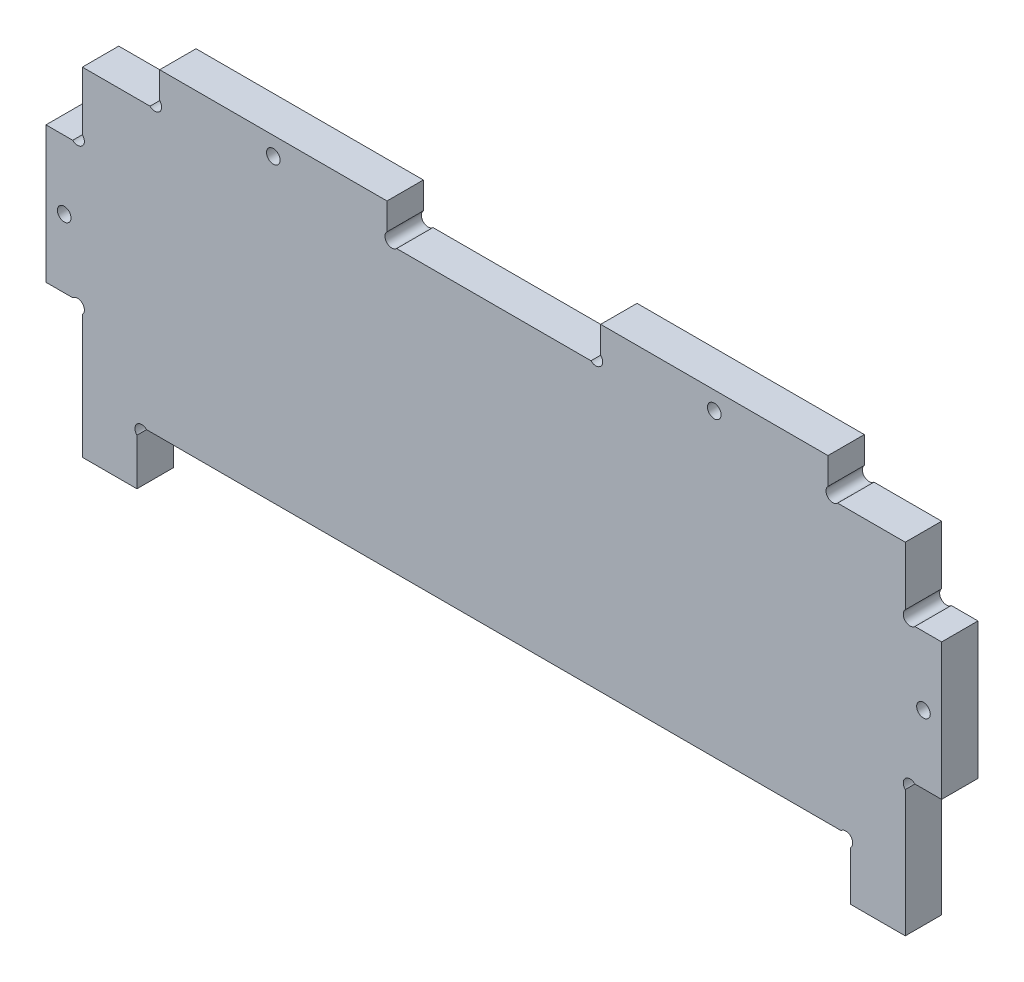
ISO-10303-21;
HEADER;
FILE_DESCRIPTION(('STEP AP214'),'2;1');
FILE_NAME('part.step','',(''),(''),'','','');
FILE_SCHEMA(('AUTOMOTIVE_DESIGN { 1 0 10303 214 1 1 1 1 }'));
ENDSEC;
DATA;
#1=APPLICATION_CONTEXT('core data for automotive mechanical design processes');
#2=APPLICATION_PROTOCOL_DEFINITION('international standard','automotive_design',2000,#1);
#3=PRODUCT_CONTEXT('',#1,'mechanical');
#4=PRODUCT('Part','Part','',(#3));
#5=PRODUCT_RELATED_PRODUCT_CATEGORY('part','',(#4));
#6=PRODUCT_DEFINITION_FORMATION('','',#4);
#7=PRODUCT_DEFINITION_CONTEXT('part definition',#1,'design');
#8=PRODUCT_DEFINITION('design','',#6,#7);
#9=PRODUCT_DEFINITION_SHAPE('','',#8);
#10=(LENGTH_UNIT() NAMED_UNIT(*) SI_UNIT(.MILLI.,.METRE.));
#11=(NAMED_UNIT(*) PLANE_ANGLE_UNIT() SI_UNIT($,.RADIAN.));
#12=(NAMED_UNIT(*) SI_UNIT($,.STERADIAN.) SOLID_ANGLE_UNIT());
#13=UNCERTAINTY_MEASURE_WITH_UNIT(LENGTH_MEASURE(1.E-05),#10,'distance_accuracy_value','');
#14=(GEOMETRIC_REPRESENTATION_CONTEXT(3) GLOBAL_UNCERTAINTY_ASSIGNED_CONTEXT((#13)) GLOBAL_UNIT_ASSIGNED_CONTEXT((#10,
#11,#12)) REPRESENTATION_CONTEXT('',''));
#15=CARTESIAN_POINT('',(0.,0.,0.));
#16=DIRECTION('',(0.,0.,1.));
#17=DIRECTION('',(1.,0.,0.));
#18=AXIS2_PLACEMENT_3D('',#15,#16,#17);
#19=CARTESIAN_POINT('',(74.7749379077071,26.5239492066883,8.));
#20=DIRECTION('',(0.,0.,-1.));
#21=DIRECTION('',(-1.,0.,0.));
#22=AXIS2_PLACEMENT_3D('',#19,#20,#21);
#23=PLANE('',#22);
#24=CARTESIAN_POINT('',(-42.1644019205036,-4.53671096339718,8.));
#25=DIRECTION('',(0.,0.,1.));
#26=DIRECTION('',(1.,0.,0.));
#27=AXIS2_PLACEMENT_3D('',#24,#25,#26);
#28=CIRCLE('',#27,1.5);
#29=CARTESIAN_POINT('',(-40.6644019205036,-4.53671096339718,8.));
#30=VERTEX_POINT('',#29);
#31=EDGE_CURVE('E581',#30,#30,#28,.T.);
#32=ORIENTED_EDGE('',*,*,#31,.F.);
#33=EDGE_LOOP('',(#32));
#34=FACE_BOUND('',#33,.T.);
#35=CARTESIAN_POINT('',(100.835598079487,29.4632890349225,8.));
#36=DIRECTION('',(0.,0.,1.));
#37=DIRECTION('',(-1.,0.,0.));
#38=AXIS2_PLACEMENT_3D('',#35,#36,#37);
#39=CIRCLE('',#38,1.5);
#40=CARTESIAN_POINT('',(99.3355980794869,29.4632890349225,8.));
#41=VERTEX_POINT('',#40);
#42=EDGE_CURVE('E288',#41,#41,#39,.T.);
#43=ORIENTED_EDGE('',*,*,#42,.F.);
#44=EDGE_LOOP('',(#43));
#45=FACE_BOUND('',#44,.T.);
#46=DIRECTION('',(0.,1.,0.));
#47=VECTOR('',#46,1.);
#48=CARTESIAN_POINT('',(125.835598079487,27.5846093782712,8.));
#49=LINE('',#48,#47);
#50=CARTESIAN_POINT('',(125.835598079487,27.5846093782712,8.));
#51=VERTEX_POINT('',#50);
#52=CARTESIAN_POINT('',(125.835598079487,33.4632890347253,8.));
#53=VERTEX_POINT('',#52);
#54=EDGE_CURVE('E355',#51,#53,#49,.T.);
#55=ORIENTED_EDGE('',*,*,#54,.T.);
#56=DIRECTION('',(-1.,0.,0.));
#57=VECTOR('',#56,1.);
#58=CARTESIAN_POINT('',(125.835598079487,33.4632890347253,8.));
#59=LINE('',#58,#57);
#60=CARTESIAN_POINT('',(75.8355980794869,33.4632890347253,8.));
#61=VERTEX_POINT('',#60);
#62=EDGE_CURVE('E170',#53,#61,#59,.T.);
#63=ORIENTED_EDGE('',*,*,#62,.T.);
#64=DIRECTION('',(0.,-1.,0.));
#65=VECTOR('',#64,1.);
#66=CARTESIAN_POINT('',(75.8355980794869,33.4632890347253,8.));
#67=LINE('',#66,#65);
#68=CARTESIAN_POINT('',(75.8355980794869,27.5846093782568,8.));
#69=VERTEX_POINT('',#68);
#70=EDGE_CURVE('E448',#61,#69,#67,.T.);
#71=ORIENTED_EDGE('',*,*,#70,.T.);
#72=CARTESIAN_POINT('',(74.7749379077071,26.5239492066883,8.));
#73=DIRECTION('',(0.,0.,-1.));
#74=DIRECTION('',(-1.,0.,0.));
#75=AXIS2_PLACEMENT_3D('',#72,#73,#74);
#76=CIRCLE('',#75,1.49999999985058);
#77=CARTESIAN_POINT('',(73.7142777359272,25.4632890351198,8.));
#78=VERTEX_POINT('',#77);
#79=EDGE_CURVE('E467',#69,#78,#76,.T.);
#80=ORIENTED_EDGE('',*,*,#79,.T.);
#81=DIRECTION('',(-1.,0.,0.));
#82=VECTOR('',#81,1.);
#83=CARTESIAN_POINT('',(30.9569184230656,25.4632890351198,8.));
#84=LINE('',#83,#82);
#85=CARTESIAN_POINT('',(30.9569184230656,25.4632890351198,8.));
#86=VERTEX_POINT('',#85);
#87=EDGE_CURVE('E464',#78,#86,#84,.T.);
#88=ORIENTED_EDGE('',*,*,#87,.T.);
#89=CARTESIAN_POINT('',(29.8962582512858,26.5239492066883,8.));
#90=DIRECTION('',(0.,0.,-1.));
#91=DIRECTION('',(1.,0.,0.));
#92=AXIS2_PLACEMENT_3D('',#89,#90,#91);
#93=CIRCLE('',#92,1.49999999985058);
#94=CARTESIAN_POINT('',(28.835598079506,27.5846093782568,8.));
#95=VERTEX_POINT('',#94);
#96=EDGE_CURVE('E466',#86,#95,#93,.T.);
#97=ORIENTED_EDGE('',*,*,#96,.T.);
#98=DIRECTION('',(0.,1.,0.));
#99=VECTOR('',#98,1.);
#100=CARTESIAN_POINT('',(28.835598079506,33.4632890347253,8.));
#101=LINE('',#100,#99);
#102=CARTESIAN_POINT('',(28.835598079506,33.4632890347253,8.));
#103=VERTEX_POINT('',#102);
#104=EDGE_CURVE('E469',#95,#103,#101,.T.);
#105=ORIENTED_EDGE('',*,*,#104,.T.);
#106=DIRECTION('',(-1.,0.,0.));
#107=VECTOR('',#106,1.);
#108=CARTESIAN_POINT('',(-21.164401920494,33.4632890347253,8.));
#109=LINE('',#108,#107);
#110=CARTESIAN_POINT('',(-21.164401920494,33.4632890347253,8.));
#111=VERTEX_POINT('',#110);
#112=EDGE_CURVE('E475',#103,#111,#109,.T.);
#113=ORIENTED_EDGE('',*,*,#112,.T.);
#114=DIRECTION('',(0.,-1.,0.));
#115=VECTOR('',#114,1.);
#116=CARTESIAN_POINT('',(-21.164401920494,27.5846093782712,8.));
#117=LINE('',#116,#115);
#118=CARTESIAN_POINT('',(-21.164401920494,27.5846093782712,8.));
#119=VERTEX_POINT('',#118);
#120=EDGE_CURVE('E477',#111,#119,#117,.T.);
#121=ORIENTED_EDGE('',*,*,#120,.T.);
#122=CARTESIAN_POINT('',(-22.2250620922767,26.5239492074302,8.));
#123=DIRECTION('',(0.,0.,-1.));
#124=DIRECTION('',(1.,0.,0.));
#125=AXIS2_PLACEMENT_3D('',#122,#123,#124);
#126=CIRCLE('',#125,1.49999999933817);
#127=CARTESIAN_POINT('',(-23.2857222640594,25.4632890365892,8.));
#128=VERTEX_POINT('',#127);
#129=EDGE_CURVE('E479',#119,#128,#126,.T.);
#130=ORIENTED_EDGE('',*,*,#129,.T.);
#131=DIRECTION('',(-1.,0.,0.));
#132=VECTOR('',#131,1.);
#133=CARTESIAN_POINT('',(-38.1644019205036,25.4632890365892,8.));
#134=LINE('',#133,#132);
#135=CARTESIAN_POINT('',(-38.1644019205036,25.4632890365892,8.));
#136=VERTEX_POINT('',#135);
#137=EDGE_CURVE('E481',#128,#136,#134,.T.);
#138=ORIENTED_EDGE('',*,*,#137,.T.);
#139=DIRECTION('',(0.,-1.,0.));
#140=VECTOR('',#139,1.);
#141=CARTESIAN_POINT('',(-38.1644019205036,13.0239492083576,8.));
#142=LINE('',#141,#140);
#143=CARTESIAN_POINT('',(-38.1644019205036,12.5846093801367,8.));
#144=VERTEX_POINT('',#143);
#145=EDGE_CURVE('E483',#136,#144,#142,.T.);
#146=ORIENTED_EDGE('',*,*,#145,.T.);
#147=CARTESIAN_POINT('',(-39.2250620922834,11.5239492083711,8.));
#148=DIRECTION('',(0.,0.,-1.));
#149=DIRECTION('',(1.,0.,0.));
#150=AXIS2_PLACEMENT_3D('',#147,#148,#149);
#151=CIRCLE('',#150,1.49999999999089);
#152=CARTESIAN_POINT('',(-40.2857222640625,10.4632890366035,8.));
#153=VERTEX_POINT('',#152);
#154=EDGE_CURVE('E485',#144,#153,#151,.T.);
#155=ORIENTED_EDGE('',*,*,#154,.T.);
#156=DIRECTION('',(-1.,0.,0.));
#157=VECTOR('',#156,1.);
#158=CARTESIAN_POINT('',(-46.1644019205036,10.4632890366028,8.));
#159=LINE('',#158,#157);
#160=CARTESIAN_POINT('',(-46.1644019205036,10.4632890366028,8.));
#161=VERTEX_POINT('',#160);
#162=EDGE_CURVE('E487',#153,#161,#159,.T.);
#163=ORIENTED_EDGE('',*,*,#162,.T.);
#164=DIRECTION('',(0.,-1.,0.));
#165=VECTOR('',#164,1.);
#166=CARTESIAN_POINT('',(-46.1644019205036,-19.5367109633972,8.));
#167=LINE('',#166,#165);
#168=CARTESIAN_POINT('',(-46.1644019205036,-19.5367109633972,8.));
#169=VERTEX_POINT('',#168);
#170=EDGE_CURVE('E489',#161,#169,#167,.T.);
#171=ORIENTED_EDGE('',*,*,#170,.T.);
#172=DIRECTION('',(1.,0.,0.));
#173=VECTOR('',#172,1.);
#174=CARTESIAN_POINT('',(-40.2857222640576,-19.5367109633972,8.));
#175=LINE('',#174,#173);
#176=CARTESIAN_POINT('',(-40.2857222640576,-19.5367109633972,8.));
#177=VERTEX_POINT('',#176);
#178=EDGE_CURVE('E491',#169,#177,#175,.T.);
#179=ORIENTED_EDGE('',*,*,#178,.T.);
#180=CARTESIAN_POINT('',(-39.2250620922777,-20.597371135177,8.));
#181=DIRECTION('',(0.,0.,-1.));
#182=DIRECTION('',(1.,0.,0.));
#183=AXIS2_PLACEMENT_3D('',#180,#181,#182);
#184=CIRCLE('',#183,1.5);
#185=CARTESIAN_POINT('',(-38.1644019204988,-21.6580313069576,8.));
#186=VERTEX_POINT('',#185);
#187=EDGE_CURVE('E493',#177,#186,#184,.T.);
#188=ORIENTED_EDGE('',*,*,#187,.T.);
#189=DIRECTION('',(0.,-1.,0.));
#190=VECTOR('',#189,1.);
#191=CARTESIAN_POINT('',(-38.1644019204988,-22.0973711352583,8.));
#192=LINE('',#191,#190);
#193=CARTESIAN_POINT('',(-38.1644019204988,-48.8692711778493,8.));
#194=VERTEX_POINT('',#193);
#195=EDGE_CURVE('E495',#186,#194,#192,.T.);
#196=ORIENTED_EDGE('',*,*,#195,.T.);
#197=DIRECTION('',(1.,0.,0.));
#198=VECTOR('',#197,1.);
#199=CARTESIAN_POINT('',(-38.1644019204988,-48.8692711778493,8.));
#200=LINE('',#199,#198);
#201=CARTESIAN_POINT('',(-26.1644019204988,-48.8692711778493,8.));
#202=VERTEX_POINT('',#201);
#203=EDGE_CURVE('E497',#194,#202,#200,.T.);
#204=ORIENTED_EDGE('',*,*,#203,.T.);
#205=DIRECTION('',(0.,1.,0.));
#206=VECTOR('',#205,1.);
#207=CARTESIAN_POINT('',(-26.1644019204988,-48.8692711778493,8.));
#208=LINE('',#207,#206);
#209=CARTESIAN_POINT('',(-26.1644019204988,-38.6580313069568,8.));
#210=VERTEX_POINT('',#209);
#211=EDGE_CURVE('E499',#202,#210,#208,.T.);
#212=ORIENTED_EDGE('',*,*,#211,.T.);
#213=CARTESIAN_POINT('',(-25.1037417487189,-37.597371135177,8.));
#214=DIRECTION('',(0.,0.,-1.));
#215=DIRECTION('',(1.,0.,0.));
#216=AXIS2_PLACEMENT_3D('',#213,#214,#215);
#217=CIRCLE('',#216,1.50000000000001);
#218=CARTESIAN_POINT('',(-24.0430815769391,-36.5367109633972,8.));
#219=VERTEX_POINT('',#218);
#220=EDGE_CURVE('E501',#210,#219,#217,.T.);
#221=ORIENTED_EDGE('',*,*,#220,.T.);
#222=DIRECTION('',(1.,0.,0.));
#223=VECTOR('',#222,1.);
#224=CARTESIAN_POINT('',(-24.0430815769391,-36.5367109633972,8.));
#225=LINE('',#224,#223);
#226=CARTESIAN_POINT('',(128.714277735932,-36.5367109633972,8.));
#227=VERTEX_POINT('',#226);
#228=EDGE_CURVE('E503',#219,#227,#225,.T.);
#229=ORIENTED_EDGE('',*,*,#228,.T.);
#230=CARTESIAN_POINT('',(129.774937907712,-37.597371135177,8.));
#231=DIRECTION('',(0.,0.,-1.));
#232=DIRECTION('',(1.,0.,0.));
#233=AXIS2_PLACEMENT_3D('',#230,#231,#232);
#234=CIRCLE('',#233,1.5);
#235=CARTESIAN_POINT('',(130.835598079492,-38.6580313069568,8.));
#236=VERTEX_POINT('',#235);
#237=EDGE_CURVE('E505',#227,#236,#234,.T.);
#238=ORIENTED_EDGE('',*,*,#237,.T.);
#239=DIRECTION('',(0.,-1.,0.));
#240=VECTOR('',#239,1.);
#241=CARTESIAN_POINT('',(130.835598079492,-49.5367109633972,8.));
#242=LINE('',#241,#240);
#243=CARTESIAN_POINT('',(130.835598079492,-49.5367109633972,8.));
#244=VERTEX_POINT('',#243);
#245=EDGE_CURVE('E507',#236,#244,#242,.T.);
#246=ORIENTED_EDGE('',*,*,#245,.T.);
#247=DIRECTION('',(1.,0.,0.));
#248=VECTOR('',#247,1.);
#249=CARTESIAN_POINT('',(142.835598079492,-49.5367109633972,8.));
#250=LINE('',#249,#248);
#251=CARTESIAN_POINT('',(142.835598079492,-49.5367109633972,8.));
#252=VERTEX_POINT('',#251);
#253=EDGE_CURVE('E509',#244,#252,#250,.T.);
#254=ORIENTED_EDGE('',*,*,#253,.T.);
#255=DIRECTION('',(0.,1.,0.));
#256=VECTOR('',#255,1.);
#257=CARTESIAN_POINT('',(142.835598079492,-36.5367109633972,8.));
#258=LINE('',#257,#256);
#259=CARTESIAN_POINT('',(142.835598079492,-21.6580313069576,8.));
#260=VERTEX_POINT('',#259);
#261=EDGE_CURVE('E511',#252,#260,#258,.T.);
#262=ORIENTED_EDGE('',*,*,#261,.T.);
#263=CARTESIAN_POINT('',(143.896258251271,-20.597371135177,8.));
#264=DIRECTION('',(0.,0.,-1.));
#265=DIRECTION('',(-1.,0.,0.));
#266=AXIS2_PLACEMENT_3D('',#263,#264,#265);
#267=CIRCLE('',#266,1.50000000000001);
#268=CARTESIAN_POINT('',(144.95691842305,-19.5367109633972,8.));
#269=VERTEX_POINT('',#268);
#270=EDGE_CURVE('E513',#260,#269,#267,.T.);
#271=ORIENTED_EDGE('',*,*,#270,.T.);
#272=DIRECTION('',(1.,0.,0.));
#273=VECTOR('',#272,1.);
#274=CARTESIAN_POINT('',(144.95691842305,-19.5367109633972,8.));
#275=LINE('',#274,#273);
#276=CARTESIAN_POINT('',(150.835598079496,-19.5367109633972,8.));
#277=VERTEX_POINT('',#276);
#278=EDGE_CURVE('E515',#269,#277,#275,.T.);
#279=ORIENTED_EDGE('',*,*,#278,.T.);
#280=DIRECTION('',(0.,1.,0.));
#281=VECTOR('',#280,1.);
#282=CARTESIAN_POINT('',(150.835598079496,-19.5367109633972,8.));
#283=LINE('',#282,#281);
#284=CARTESIAN_POINT('',(150.835598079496,10.4632890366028,8.));
#285=VERTEX_POINT('',#284);
#286=EDGE_CURVE('E517',#277,#285,#283,.T.);
#287=ORIENTED_EDGE('',*,*,#286,.T.);
#288=DIRECTION('',(-1.,0.,0.));
#289=VECTOR('',#288,1.);
#290=CARTESIAN_POINT('',(150.835598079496,10.4632890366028,8.));
#291=LINE('',#290,#289);
#292=CARTESIAN_POINT('',(144.956918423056,10.4632890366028,8.));
#293=VERTEX_POINT('',#292);
#294=EDGE_CURVE('E519',#285,#293,#291,.T.);
#295=ORIENTED_EDGE('',*,*,#294,.T.);
#296=CARTESIAN_POINT('',(143.896258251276,11.5239492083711,8.));
#297=DIRECTION('',(0.,0.,-1.));
#298=DIRECTION('',(-1.,0.,0.));
#299=AXIS2_PLACEMENT_3D('',#296,#297,#298);
#300=CIRCLE('',#299,1.4999999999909);
#301=CARTESIAN_POINT('',(142.835598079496,12.5846093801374,8.));
#302=VERTEX_POINT('',#301);
#303=EDGE_CURVE('E267',#293,#302,#300,.T.);
#304=ORIENTED_EDGE('',*,*,#303,.T.);
#305=DIRECTION('',(0.,1.,0.));
#306=VECTOR('',#305,1.);
#307=CARTESIAN_POINT('',(142.835598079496,12.5846093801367,8.));
#308=LINE('',#307,#306);
#309=CARTESIAN_POINT('',(142.835598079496,25.4632890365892,8.));
#310=VERTEX_POINT('',#309);
#311=EDGE_CURVE('E261',#302,#310,#308,.T.);
#312=ORIENTED_EDGE('',*,*,#311,.T.);
#313=DIRECTION('',(-1.,0.,0.));
#314=VECTOR('',#313,1.);
#315=CARTESIAN_POINT('',(142.835598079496,25.4632890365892,8.));
#316=LINE('',#315,#314);
#317=CARTESIAN_POINT('',(127.956918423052,25.4632890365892,8.));
#318=VERTEX_POINT('',#317);
#319=EDGE_CURVE('E265',#310,#318,#316,.T.);
#320=ORIENTED_EDGE('',*,*,#319,.T.);
#321=CARTESIAN_POINT('',(126.89625825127,26.5239492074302,8.));
#322=DIRECTION('',(0.,0.,-1.));
#323=DIRECTION('',(-1.,0.,0.));
#324=AXIS2_PLACEMENT_3D('',#321,#322,#323);
#325=CIRCLE('',#324,1.49999999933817);
#326=EDGE_CURVE('E49',#318,#51,#325,.T.);
#327=ORIENTED_EDGE('',*,*,#326,.T.);
#328=EDGE_LOOP('',(#55,#63,#71,#80,#88,#97,#105,#113,#121,#130,#138,#146,#155,#163,#171,#179,
#188,#196,#204,#212,#221,#229,#238,#246,#254,#262,#271,#279,#287,#295,#304,#312,#320,#327));
#329=FACE_BOUND('',#328,.T.);
#330=CARTESIAN_POINT('',(146.835598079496,-4.53671096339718,8.));
#331=DIRECTION('',(0.,0.,1.));
#332=DIRECTION('',(-1.,0.,0.));
#333=AXIS2_PLACEMENT_3D('',#330,#331,#332);
#334=CIRCLE('',#333,1.5);
#335=CARTESIAN_POINT('',(145.335598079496,-4.53671096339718,8.));
#336=VERTEX_POINT('',#335);
#337=EDGE_CURVE('E587',#336,#336,#334,.T.);
#338=ORIENTED_EDGE('',*,*,#337,.F.);
#339=EDGE_LOOP('',(#338));
#340=FACE_BOUND('',#339,.T.);
#341=CARTESIAN_POINT('',(3.83559807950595,29.4632890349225,8.));
#342=DIRECTION('',(0.,0.,1.));
#343=DIRECTION('',(1.,0.,0.));
#344=AXIS2_PLACEMENT_3D('',#341,#342,#343);
#345=CIRCLE('',#344,1.5);
#346=CARTESIAN_POINT('',(5.33559807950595,29.4632890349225,8.));
#347=VERTEX_POINT('',#346);
#348=EDGE_CURVE('E572',#347,#347,#345,.T.);
#349=ORIENTED_EDGE('',*,*,#348,.F.);
#350=EDGE_LOOP('',(#349));
#351=FACE_BOUND('',#350,.T.);
#352=ADVANCED_FACE('F32',(#34,#45,#329,#340,#351),#23,.F.);
#353=CARTESIAN_POINT('',(74.7749379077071,26.5239492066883,0.));
#354=DIRECTION('',(0.,0.,-1.));
#355=DIRECTION('',(-1.,0.,0.));
#356=AXIS2_PLACEMENT_3D('',#353,#354,#355);
#357=PLANE('',#356);
#358=CARTESIAN_POINT('',(-42.1644019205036,-4.53671096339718,0.));
#359=DIRECTION('',(0.,0.,1.));
#360=DIRECTION('',(1.,0.,0.));
#361=AXIS2_PLACEMENT_3D('',#358,#359,#360);
#362=CIRCLE('',#361,1.5);
#363=CARTESIAN_POINT('',(-40.6644019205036,-4.53671096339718,0.));
#364=VERTEX_POINT('',#363);
#365=EDGE_CURVE('E578',#364,#364,#362,.T.);
#366=ORIENTED_EDGE('',*,*,#365,.T.);
#367=EDGE_LOOP('',(#366));
#368=FACE_BOUND('',#367,.T.);
#369=CARTESIAN_POINT('',(100.835598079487,29.4632890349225,0.));
#370=DIRECTION('',(0.,0.,1.));
#371=DIRECTION('',(-1.,0.,0.));
#372=AXIS2_PLACEMENT_3D('',#369,#370,#371);
#373=CIRCLE('',#372,1.5);
#374=CARTESIAN_POINT('',(99.3355980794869,29.4632890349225,0.));
#375=VERTEX_POINT('',#374);
#376=EDGE_CURVE('E590',#375,#375,#373,.T.);
#377=ORIENTED_EDGE('',*,*,#376,.T.);
#378=EDGE_LOOP('',(#377));
#379=FACE_BOUND('',#378,.T.);
#380=DIRECTION('',(0.,1.,0.));
#381=VECTOR('',#380,1.);
#382=CARTESIAN_POINT('',(125.835598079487,27.5846093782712,0.));
#383=LINE('',#382,#381);
#384=CARTESIAN_POINT('',(125.835598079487,27.5846093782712,0.));
#385=VERTEX_POINT('',#384);
#386=CARTESIAN_POINT('',(125.835598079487,33.4632890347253,0.));
#387=VERTEX_POINT('',#386);
#388=EDGE_CURVE('E284',#385,#387,#383,.T.);
#389=ORIENTED_EDGE('',*,*,#388,.F.);
#390=CARTESIAN_POINT('',(126.89625825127,26.5239492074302,0.));
#391=DIRECTION('',(0.,0.,-1.));
#392=DIRECTION('',(-1.,0.,0.));
#393=AXIS2_PLACEMENT_3D('',#390,#391,#392);
#394=CIRCLE('',#393,1.49999999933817);
#395=CARTESIAN_POINT('',(127.956918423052,25.4632890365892,0.));
#396=VERTEX_POINT('',#395);
#397=EDGE_CURVE('E162',#396,#385,#394,.T.);
#398=ORIENTED_EDGE('',*,*,#397,.F.);
#399=DIRECTION('',(-1.,0.,0.));
#400=VECTOR('',#399,1.);
#401=CARTESIAN_POINT('',(142.835598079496,25.4632890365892,0.));
#402=LINE('',#401,#400);
#403=CARTESIAN_POINT('',(142.835598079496,25.4632890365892,0.));
#404=VERTEX_POINT('',#403);
#405=EDGE_CURVE('E156',#404,#396,#402,.T.);
#406=ORIENTED_EDGE('',*,*,#405,.F.);
#407=DIRECTION('',(0.,1.,0.));
#408=VECTOR('',#407,1.);
#409=CARTESIAN_POINT('',(142.835598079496,13.0239492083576,0.));
#410=LINE('',#409,#408);
#411=CARTESIAN_POINT('',(142.835598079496,12.5846093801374,0.));
#412=VERTEX_POINT('',#411);
#413=EDGE_CURVE('E274',#412,#404,#410,.T.);
#414=ORIENTED_EDGE('',*,*,#413,.F.);
#415=CARTESIAN_POINT('',(143.896258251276,11.5239492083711,0.));
#416=DIRECTION('',(0.,0.,-1.));
#417=DIRECTION('',(-1.,0.,0.));
#418=AXIS2_PLACEMENT_3D('',#415,#416,#417);
#419=CIRCLE('',#418,1.4999999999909);
#420=CARTESIAN_POINT('',(144.956918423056,10.4632890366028,0.));
#421=VERTEX_POINT('',#420);
#422=EDGE_CURVE('E349',#421,#412,#419,.T.);
#423=ORIENTED_EDGE('',*,*,#422,.F.);
#424=DIRECTION('',(-1.,0.,0.));
#425=VECTOR('',#424,1.);
#426=CARTESIAN_POINT('',(150.835598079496,10.4632890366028,0.));
#427=LINE('',#426,#425);
#428=CARTESIAN_POINT('',(150.835598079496,10.4632890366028,0.));
#429=VERTEX_POINT('',#428);
#430=EDGE_CURVE('E347',#429,#421,#427,.T.);
#431=ORIENTED_EDGE('',*,*,#430,.F.);
#432=DIRECTION('',(0.,1.,0.));
#433=VECTOR('',#432,1.);
#434=CARTESIAN_POINT('',(150.835598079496,-19.5367109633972,0.));
#435=LINE('',#434,#433);
#436=CARTESIAN_POINT('',(150.835598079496,-19.5367109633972,0.));
#437=VERTEX_POINT('',#436);
#438=EDGE_CURVE('E345',#437,#429,#435,.T.);
#439=ORIENTED_EDGE('',*,*,#438,.F.);
#440=DIRECTION('',(1.,0.,0.));
#441=VECTOR('',#440,1.);
#442=CARTESIAN_POINT('',(144.95691842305,-19.5367109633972,0.));
#443=LINE('',#442,#441);
#444=CARTESIAN_POINT('',(144.95691842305,-19.5367109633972,0.));
#445=VERTEX_POINT('',#444);
#446=EDGE_CURVE('E343',#445,#437,#443,.T.);
#447=ORIENTED_EDGE('',*,*,#446,.F.);
#448=CARTESIAN_POINT('',(143.896258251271,-20.597371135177,0.));
#449=DIRECTION('',(0.,0.,-1.));
#450=DIRECTION('',(-1.,0.,0.));
#451=AXIS2_PLACEMENT_3D('',#448,#449,#450);
#452=CIRCLE('',#451,1.50000000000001);
#453=CARTESIAN_POINT('',(142.835598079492,-21.6580313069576,0.));
#454=VERTEX_POINT('',#453);
#455=EDGE_CURVE('E341',#454,#445,#452,.T.);
#456=ORIENTED_EDGE('',*,*,#455,.F.);
#457=DIRECTION('',(0.,1.,0.));
#458=VECTOR('',#457,1.);
#459=CARTESIAN_POINT('',(142.835598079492,-22.0973711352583,0.));
#460=LINE('',#459,#458);
#461=CARTESIAN_POINT('',(142.835598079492,-49.5367109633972,0.));
#462=VERTEX_POINT('',#461);
#463=EDGE_CURVE('E339',#462,#454,#460,.T.);
#464=ORIENTED_EDGE('',*,*,#463,.F.);
#465=DIRECTION('',(1.,0.,0.));
#466=VECTOR('',#465,1.);
#467=CARTESIAN_POINT('',(142.835598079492,-49.5367109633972,0.));
#468=LINE('',#467,#466);
#469=CARTESIAN_POINT('',(130.835598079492,-49.5367109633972,0.));
#470=VERTEX_POINT('',#469);
#471=EDGE_CURVE('E336',#470,#462,#468,.T.);
#472=ORIENTED_EDGE('',*,*,#471,.F.);
#473=DIRECTION('',(0.,-1.,0.));
#474=VECTOR('',#473,1.);
#475=CARTESIAN_POINT('',(130.835598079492,-49.5367109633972,0.));
#476=LINE('',#475,#474);
#477=CARTESIAN_POINT('',(130.835598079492,-38.6580313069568,0.));
#478=VERTEX_POINT('',#477);
#479=EDGE_CURVE('E334',#478,#470,#476,.T.);
#480=ORIENTED_EDGE('',*,*,#479,.F.);
#481=CARTESIAN_POINT('',(129.774937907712,-37.597371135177,0.));
#482=DIRECTION('',(0.,0.,-1.));
#483=DIRECTION('',(1.,0.,0.));
#484=AXIS2_PLACEMENT_3D('',#481,#482,#483);
#485=CIRCLE('',#484,1.5);
#486=CARTESIAN_POINT('',(128.714277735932,-36.5367109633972,0.));
#487=VERTEX_POINT('',#486);
#488=EDGE_CURVE('E332',#487,#478,#485,.T.);
#489=ORIENTED_EDGE('',*,*,#488,.F.);
#490=DIRECTION('',(1.,0.,0.));
#491=VECTOR('',#490,1.);
#492=CARTESIAN_POINT('',(-24.0430815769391,-36.5367109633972,0.));
#493=LINE('',#492,#491);
#494=CARTESIAN_POINT('',(-24.0430815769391,-36.5367109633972,0.));
#495=VERTEX_POINT('',#494);
#496=EDGE_CURVE('E330',#495,#487,#493,.T.);
#497=ORIENTED_EDGE('',*,*,#496,.F.);
#498=CARTESIAN_POINT('',(-25.1037417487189,-37.597371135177,0.));
#499=DIRECTION('',(0.,0.,-1.));
#500=DIRECTION('',(1.,0.,0.));
#501=AXIS2_PLACEMENT_3D('',#498,#499,#500);
#502=CIRCLE('',#501,1.50000000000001);
#503=CARTESIAN_POINT('',(-26.1644019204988,-38.6580313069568,0.));
#504=VERTEX_POINT('',#503);
#505=EDGE_CURVE('E328',#504,#495,#502,.T.);
#506=ORIENTED_EDGE('',*,*,#505,.F.);
#507=DIRECTION('',(0.,1.,0.));
#508=VECTOR('',#507,1.);
#509=CARTESIAN_POINT('',(-26.1644019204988,-48.8692711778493,0.));
#510=LINE('',#509,#508);
#511=CARTESIAN_POINT('',(-26.1644019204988,-48.8692711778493,0.));
#512=VERTEX_POINT('',#511);
#513=EDGE_CURVE('E326',#512,#504,#510,.T.);
#514=ORIENTED_EDGE('',*,*,#513,.F.);
#515=DIRECTION('',(1.,0.,0.));
#516=VECTOR('',#515,1.);
#517=CARTESIAN_POINT('',(-38.1644019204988,-48.8692711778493,0.));
#518=LINE('',#517,#516);
#519=CARTESIAN_POINT('',(-38.1644019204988,-48.8692711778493,0.));
#520=VERTEX_POINT('',#519);
#521=EDGE_CURVE('E324',#520,#512,#518,.T.);
#522=ORIENTED_EDGE('',*,*,#521,.F.);
#523=DIRECTION('',(0.,-1.,0.));
#524=VECTOR('',#523,1.);
#525=CARTESIAN_POINT('',(-38.1644019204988,-36.5367109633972,0.));
#526=LINE('',#525,#524);
#527=CARTESIAN_POINT('',(-38.1644019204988,-21.6580313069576,0.));
#528=VERTEX_POINT('',#527);
#529=EDGE_CURVE('E322',#528,#520,#526,.T.);
#530=ORIENTED_EDGE('',*,*,#529,.F.);
#531=CARTESIAN_POINT('',(-39.2250620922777,-20.597371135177,0.));
#532=DIRECTION('',(0.,0.,-1.));
#533=DIRECTION('',(1.,0.,0.));
#534=AXIS2_PLACEMENT_3D('',#531,#532,#533);
#535=CIRCLE('',#534,1.5);
#536=CARTESIAN_POINT('',(-40.2857222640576,-19.5367109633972,0.));
#537=VERTEX_POINT('',#536);
#538=EDGE_CURVE('E319',#537,#528,#535,.T.);
#539=ORIENTED_EDGE('',*,*,#538,.F.);
#540=DIRECTION('',(1.,0.,0.));
#541=VECTOR('',#540,1.);
#542=CARTESIAN_POINT('',(-40.2857222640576,-19.5367109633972,0.));
#543=LINE('',#542,#541);
#544=CARTESIAN_POINT('',(-46.1644019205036,-19.5367109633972,0.));
#545=VERTEX_POINT('',#544);
#546=EDGE_CURVE('E317',#545,#537,#543,.T.);
#547=ORIENTED_EDGE('',*,*,#546,.F.);
#548=DIRECTION('',(0.,-1.,0.));
#549=VECTOR('',#548,1.);
#550=CARTESIAN_POINT('',(-46.1644019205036,-19.5367109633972,0.));
#551=LINE('',#550,#549);
#552=CARTESIAN_POINT('',(-46.1644019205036,10.4632890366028,0.));
#553=VERTEX_POINT('',#552);
#554=EDGE_CURVE('E315',#553,#545,#551,.T.);
#555=ORIENTED_EDGE('',*,*,#554,.F.);
#556=DIRECTION('',(-1.,0.,0.));
#557=VECTOR('',#556,1.);
#558=CARTESIAN_POINT('',(-46.1644019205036,10.4632890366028,0.));
#559=LINE('',#558,#557);
#560=CARTESIAN_POINT('',(-40.2857222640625,10.4632890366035,0.));
#561=VERTEX_POINT('',#560);
#562=EDGE_CURVE('E313',#561,#553,#559,.T.);
#563=ORIENTED_EDGE('',*,*,#562,.F.);
#564=CARTESIAN_POINT('',(-39.2250620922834,11.5239492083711,0.));
#565=DIRECTION('',(0.,0.,-1.));
#566=DIRECTION('',(1.,0.,0.));
#567=AXIS2_PLACEMENT_3D('',#564,#565,#566);
#568=CIRCLE('',#567,1.49999999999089);
#569=CARTESIAN_POINT('',(-38.1644019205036,12.5846093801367,0.));
#570=VERTEX_POINT('',#569);
#571=EDGE_CURVE('E311',#570,#561,#568,.T.);
#572=ORIENTED_EDGE('',*,*,#571,.F.);
#573=DIRECTION('',(0.,-1.,0.));
#574=VECTOR('',#573,1.);
#575=CARTESIAN_POINT('',(-38.1644019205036,12.5846093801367,0.));
#576=LINE('',#575,#574);
#577=CARTESIAN_POINT('',(-38.1644019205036,25.4632890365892,0.));
#578=VERTEX_POINT('',#577);
#579=EDGE_CURVE('E309',#578,#570,#576,.T.);
#580=ORIENTED_EDGE('',*,*,#579,.F.);
#581=DIRECTION('',(-1.,0.,0.));
#582=VECTOR('',#581,1.);
#583=CARTESIAN_POINT('',(-38.1644019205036,25.4632890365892,0.));
#584=LINE('',#583,#582);
#585=CARTESIAN_POINT('',(-23.2857222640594,25.4632890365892,0.));
#586=VERTEX_POINT('',#585);
#587=EDGE_CURVE('E306',#586,#578,#584,.T.);
#588=ORIENTED_EDGE('',*,*,#587,.F.);
#589=CARTESIAN_POINT('',(-22.2250620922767,26.5239492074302,0.));
#590=DIRECTION('',(0.,0.,-1.));
#591=DIRECTION('',(1.,0.,0.));
#592=AXIS2_PLACEMENT_3D('',#589,#590,#591);
#593=CIRCLE('',#592,1.49999999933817);
#594=CARTESIAN_POINT('',(-21.164401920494,27.5846093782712,0.));
#595=VERTEX_POINT('',#594);
#596=EDGE_CURVE('E304',#595,#586,#593,.T.);
#597=ORIENTED_EDGE('',*,*,#596,.F.);
#598=DIRECTION('',(0.,-1.,0.));
#599=VECTOR('',#598,1.);
#600=CARTESIAN_POINT('',(-21.164401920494,27.5846093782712,0.));
#601=LINE('',#600,#599);
#602=CARTESIAN_POINT('',(-21.164401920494,33.4632890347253,0.));
#603=VERTEX_POINT('',#602);
#604=EDGE_CURVE('E302',#603,#595,#601,.T.);
#605=ORIENTED_EDGE('',*,*,#604,.F.);
#606=DIRECTION('',(-1.,0.,0.));
#607=VECTOR('',#606,1.);
#608=CARTESIAN_POINT('',(-21.164401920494,33.4632890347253,0.));
#609=LINE('',#608,#607);
#610=CARTESIAN_POINT('',(28.835598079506,33.4632890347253,0.));
#611=VERTEX_POINT('',#610);
#612=EDGE_CURVE('E300',#611,#603,#609,.T.);
#613=ORIENTED_EDGE('',*,*,#612,.F.);
#614=DIRECTION('',(0.,1.,0.));
#615=VECTOR('',#614,1.);
#616=CARTESIAN_POINT('',(28.835598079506,33.4632890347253,0.));
#617=LINE('',#616,#615);
#618=CARTESIAN_POINT('',(28.835598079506,27.5846093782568,0.));
#619=VERTEX_POINT('',#618);
#620=EDGE_CURVE('E298',#619,#611,#617,.T.);
#621=ORIENTED_EDGE('',*,*,#620,.F.);
#622=CARTESIAN_POINT('',(29.8962582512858,26.5239492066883,0.));
#623=DIRECTION('',(0.,0.,-1.));
#624=DIRECTION('',(1.,0.,0.));
#625=AXIS2_PLACEMENT_3D('',#622,#623,#624);
#626=CIRCLE('',#625,1.49999999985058);
#627=CARTESIAN_POINT('',(30.9569184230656,25.4632890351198,0.));
#628=VERTEX_POINT('',#627);
#629=EDGE_CURVE('E296',#628,#619,#626,.T.);
#630=ORIENTED_EDGE('',*,*,#629,.F.);
#631=DIRECTION('',(-1.,0.,0.));
#632=VECTOR('',#631,1.);
#633=CARTESIAN_POINT('',(30.9569184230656,25.4632890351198,0.));
#634=LINE('',#633,#632);
#635=CARTESIAN_POINT('',(73.7142777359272,25.4632890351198,0.));
#636=VERTEX_POINT('',#635);
#637=EDGE_CURVE('E294',#636,#628,#634,.T.);
#638=ORIENTED_EDGE('',*,*,#637,.F.);
#639=CARTESIAN_POINT('',(74.7749379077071,26.5239492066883,0.));
#640=DIRECTION('',(0.,0.,-1.));
#641=DIRECTION('',(-1.,0.,0.));
#642=AXIS2_PLACEMENT_3D('',#639,#640,#641);
#643=CIRCLE('',#642,1.49999999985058);
#644=CARTESIAN_POINT('',(75.8355980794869,27.5846093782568,0.));
#645=VERTEX_POINT('',#644);
#646=EDGE_CURVE('E292',#645,#636,#643,.T.);
#647=ORIENTED_EDGE('',*,*,#646,.F.);
#648=DIRECTION('',(0.,-1.,0.));
#649=VECTOR('',#648,1.);
#650=CARTESIAN_POINT('',(75.8355980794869,33.4632890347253,0.));
#651=LINE('',#650,#649);
#652=CARTESIAN_POINT('',(75.8355980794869,33.4632890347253,0.));
#653=VERTEX_POINT('',#652);
#654=EDGE_CURVE('E290',#653,#645,#651,.T.);
#655=ORIENTED_EDGE('',*,*,#654,.F.);
#656=DIRECTION('',(-1.,0.,0.));
#657=VECTOR('',#656,1.);
#658=CARTESIAN_POINT('',(125.835598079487,33.4632890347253,0.));
#659=LINE('',#658,#657);
#660=EDGE_CURVE('E287',#387,#653,#659,.T.);
#661=ORIENTED_EDGE('',*,*,#660,.F.);
#662=EDGE_LOOP('',(#389,#398,#406,#414,#423,#431,#439,#447,#456,#464,#472,#480,#489,#497,#506,
#514,#522,#530,#539,#547,#555,#563,#572,#580,#588,#597,#605,#613,#621,#630,#638,#647,#655,#661));
#663=FACE_BOUND('',#662,.T.);
#664=CARTESIAN_POINT('',(146.835598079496,-4.53671096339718,0.));
#665=DIRECTION('',(0.,0.,1.));
#666=DIRECTION('',(-1.,0.,0.));
#667=AXIS2_PLACEMENT_3D('',#664,#665,#666);
#668=CIRCLE('',#667,1.5);
#669=CARTESIAN_POINT('',(145.335598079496,-4.53671096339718,0.));
#670=VERTEX_POINT('',#669);
#671=EDGE_CURVE('E584',#670,#670,#668,.T.);
#672=ORIENTED_EDGE('',*,*,#671,.T.);
#673=EDGE_LOOP('',(#672));
#674=FACE_BOUND('',#673,.T.);
#675=CARTESIAN_POINT('',(3.83559807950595,29.4632890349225,0.));
#676=DIRECTION('',(0.,0.,1.));
#677=DIRECTION('',(1.,0.,0.));
#678=AXIS2_PLACEMENT_3D('',#675,#676,#677);
#679=CIRCLE('',#678,1.5);
#680=CARTESIAN_POINT('',(5.33559807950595,29.4632890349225,0.));
#681=VERTEX_POINT('',#680);
#682=EDGE_CURVE('E575',#681,#681,#679,.T.);
#683=ORIENTED_EDGE('',*,*,#682,.T.);
#684=EDGE_LOOP('',(#683));
#685=FACE_BOUND('',#684,.T.);
#686=ADVANCED_FACE('F452',(#368,#379,#663,#674,#685),#357,.T.);
#687=CARTESIAN_POINT('',(125.835598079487,27.5846093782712,8.));
#688=DIRECTION('',(-1.,0.,0.));
#689=DIRECTION('',(0.,0.,1.));
#690=AXIS2_PLACEMENT_3D('',#687,#688,#689);
#691=PLANE('',#690);
#692=ORIENTED_EDGE('',*,*,#388,.T.);
#693=DIRECTION('',(0.,0.,-1.));
#694=VECTOR('',#693,1.);
#695=CARTESIAN_POINT('',(125.835598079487,33.4632890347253,8.));
#696=LINE('',#695,#694);
#697=EDGE_CURVE('E11',#53,#387,#696,.T.);
#698=ORIENTED_EDGE('',*,*,#697,.F.);
#699=ORIENTED_EDGE('',*,*,#54,.F.);
#700=DIRECTION('',(0.,0.,-1.));
#701=VECTOR('',#700,1.);
#702=CARTESIAN_POINT('',(125.835598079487,27.5846093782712,8.));
#703=LINE('',#702,#701);
#704=EDGE_CURVE('E280',#51,#385,#703,.T.);
#705=ORIENTED_EDGE('',*,*,#704,.T.);
#706=EDGE_LOOP('',(#692,#698,#699,#705));
#707=FACE_BOUND('',#706,.T.);
#708=ADVANCED_FACE('F34',(#707),#691,.F.);
#709=CARTESIAN_POINT('',(125.835598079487,33.4632890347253,8.));
#710=DIRECTION('',(0.,-1.,0.));
#711=DIRECTION('',(0.,0.,-1.));
#712=AXIS2_PLACEMENT_3D('',#709,#710,#711);
#713=PLANE('',#712);
#714=ORIENTED_EDGE('',*,*,#660,.T.);
#715=DIRECTION('',(0.,0.,-1.));
#716=VECTOR('',#715,1.);
#717=CARTESIAN_POINT('',(75.8355980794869,33.4632890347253,8.));
#718=LINE('',#717,#716);
#719=EDGE_CURVE('E41',#61,#653,#718,.T.);
#720=ORIENTED_EDGE('',*,*,#719,.F.);
#721=ORIENTED_EDGE('',*,*,#62,.F.);
#722=ORIENTED_EDGE('',*,*,#697,.T.);
#723=EDGE_LOOP('',(#714,#720,#721,#722));
#724=FACE_BOUND('',#723,.T.);
#725=ADVANCED_FACE('F925',(#724),#713,.F.);
#726=CARTESIAN_POINT('',(75.8355980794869,33.4632890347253,8.));
#727=DIRECTION('',(1.,0.,0.));
#728=DIRECTION('',(0.,0.,-1.));
#729=AXIS2_PLACEMENT_3D('',#726,#727,#728);
#730=PLANE('',#729);
#731=ORIENTED_EDGE('',*,*,#654,.T.);
#732=DIRECTION('',(0.,0.,-1.));
#733=VECTOR('',#732,1.);
#734=CARTESIAN_POINT('',(75.8355980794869,27.5846093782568,8.));
#735=LINE('',#734,#733);
#736=EDGE_CURVE('E440',#69,#645,#735,.T.);
#737=ORIENTED_EDGE('',*,*,#736,.F.);
#738=ORIENTED_EDGE('',*,*,#70,.F.);
#739=ORIENTED_EDGE('',*,*,#719,.T.);
#740=EDGE_LOOP('',(#731,#737,#738,#739));
#741=FACE_BOUND('',#740,.T.);
#742=ADVANCED_FACE('F446',(#741),#730,.F.);
#743=CARTESIAN_POINT('',(74.7749379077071,26.5239492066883,8.));
#744=DIRECTION('',(0.,0.,-1.));
#745=DIRECTION('',(-1.,0.,0.));
#746=AXIS2_PLACEMENT_3D('',#743,#744,#745);
#747=CYLINDRICAL_SURFACE('',#746,1.49999999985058);
#748=ORIENTED_EDGE('',*,*,#646,.T.);
#749=DIRECTION('',(0.,0.,-1.));
#750=VECTOR('',#749,1.);
#751=CARTESIAN_POINT('',(73.7142777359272,25.4632890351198,8.));
#752=LINE('',#751,#750);
#753=EDGE_CURVE('E437',#78,#636,#752,.T.);
#754=ORIENTED_EDGE('',*,*,#753,.F.);
#755=ORIENTED_EDGE('',*,*,#79,.F.);
#756=ORIENTED_EDGE('',*,*,#736,.T.);
#757=EDGE_LOOP('',(#748,#754,#755,#756));
#758=FACE_BOUND('',#757,.T.);
#759=ADVANCED_FACE('F458',(#758),#747,.F.);
#760=CARTESIAN_POINT('',(30.9569184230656,25.4632890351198,8.));
#761=DIRECTION('',(0.,-1.,0.));
#762=DIRECTION('',(0.,0.,-1.));
#763=AXIS2_PLACEMENT_3D('',#760,#761,#762);
#764=PLANE('',#763);
#765=ORIENTED_EDGE('',*,*,#637,.T.);
#766=DIRECTION('',(0.,0.,-1.));
#767=VECTOR('',#766,1.);
#768=CARTESIAN_POINT('',(30.9569184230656,25.4632890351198,8.));
#769=LINE('',#768,#767);
#770=EDGE_CURVE('E434',#86,#628,#769,.T.);
#771=ORIENTED_EDGE('',*,*,#770,.F.);
#772=ORIENTED_EDGE('',*,*,#87,.F.);
#773=ORIENTED_EDGE('',*,*,#753,.T.);
#774=EDGE_LOOP('',(#765,#771,#772,#773));
#775=FACE_BOUND('',#774,.T.);
#776=ADVANCED_FACE('F462',(#775),#764,.F.);
#777=CARTESIAN_POINT('',(29.8962582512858,26.5239492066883,8.));
#778=DIRECTION('',(0.,0.,-1.));
#779=DIRECTION('',(-1.,0.,0.));
#780=AXIS2_PLACEMENT_3D('',#777,#778,#779);
#781=CYLINDRICAL_SURFACE('',#780,1.49999999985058);
#782=ORIENTED_EDGE('',*,*,#629,.T.);
#783=DIRECTION('',(0.,0.,-1.));
#784=VECTOR('',#783,1.);
#785=CARTESIAN_POINT('',(28.835598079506,27.5846093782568,8.));
#786=LINE('',#785,#784);
#787=EDGE_CURVE('E431',#95,#619,#786,.T.);
#788=ORIENTED_EDGE('',*,*,#787,.F.);
#789=ORIENTED_EDGE('',*,*,#96,.F.);
#790=ORIENTED_EDGE('',*,*,#770,.T.);
#791=EDGE_LOOP('',(#782,#788,#789,#790));
#792=FACE_BOUND('',#791,.T.);
#793=ADVANCED_FACE('F890',(#792),#781,.F.);
#794=CARTESIAN_POINT('',(28.835598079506,33.4632890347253,8.));
#795=DIRECTION('',(-1.,0.,0.));
#796=DIRECTION('',(0.,0.,1.));
#797=AXIS2_PLACEMENT_3D('',#794,#795,#796);
#798=PLANE('',#797);
#799=ORIENTED_EDGE('',*,*,#620,.T.);
#800=DIRECTION('',(0.,0.,-1.));
#801=VECTOR('',#800,1.);
#802=CARTESIAN_POINT('',(28.835598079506,33.4632890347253,8.));
#803=LINE('',#802,#801);
#804=EDGE_CURVE('E428',#103,#611,#803,.T.);
#805=ORIENTED_EDGE('',*,*,#804,.F.);
#806=ORIENTED_EDGE('',*,*,#104,.F.);
#807=ORIENTED_EDGE('',*,*,#787,.T.);
#808=EDGE_LOOP('',(#799,#805,#806,#807));
#809=FACE_BOUND('',#808,.T.);
#810=ADVANCED_FACE('F880',(#809),#798,.F.);
#811=CARTESIAN_POINT('',(-21.164401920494,33.4632890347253,8.));
#812=DIRECTION('',(0.,-1.,0.));
#813=DIRECTION('',(0.,0.,-1.));
#814=AXIS2_PLACEMENT_3D('',#811,#812,#813);
#815=PLANE('',#814);
#816=ORIENTED_EDGE('',*,*,#612,.T.);
#817=DIRECTION('',(0.,0.,-1.));
#818=VECTOR('',#817,1.);
#819=CARTESIAN_POINT('',(-21.164401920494,33.4632890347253,8.));
#820=LINE('',#819,#818);
#821=EDGE_CURVE('E425',#111,#603,#820,.T.);
#822=ORIENTED_EDGE('',*,*,#821,.F.);
#823=ORIENTED_EDGE('',*,*,#112,.F.);
#824=ORIENTED_EDGE('',*,*,#804,.T.);
#825=EDGE_LOOP('',(#816,#822,#823,#824));
#826=FACE_BOUND('',#825,.T.);
#827=ADVANCED_FACE('F870',(#826),#815,.F.);
#828=CARTESIAN_POINT('',(-21.164401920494,27.5846093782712,8.));
#829=DIRECTION('',(1.,0.,0.));
#830=DIRECTION('',(0.,0.,-1.));
#831=AXIS2_PLACEMENT_3D('',#828,#829,#830);
#832=PLANE('',#831);
#833=ORIENTED_EDGE('',*,*,#604,.T.);
#834=DIRECTION('',(0.,0.,-1.));
#835=VECTOR('',#834,1.);
#836=CARTESIAN_POINT('',(-21.164401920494,27.5846093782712,8.));
#837=LINE('',#836,#835);
#838=EDGE_CURVE('E422',#119,#595,#837,.T.);
#839=ORIENTED_EDGE('',*,*,#838,.F.);
#840=ORIENTED_EDGE('',*,*,#120,.F.);
#841=ORIENTED_EDGE('',*,*,#821,.T.);
#842=EDGE_LOOP('',(#833,#839,#840,#841));
#843=FACE_BOUND('',#842,.T.);
#844=ADVANCED_FACE('F860',(#843),#832,.F.);
#845=CARTESIAN_POINT('',(-22.2250620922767,26.5239492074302,8.));
#846=DIRECTION('',(0.,0.,-1.));
#847=DIRECTION('',(-1.,0.,0.));
#848=AXIS2_PLACEMENT_3D('',#845,#846,#847);
#849=CYLINDRICAL_SURFACE('',#848,1.49999999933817);
#850=ORIENTED_EDGE('',*,*,#596,.T.);
#851=DIRECTION('',(0.,0.,-1.));
#852=VECTOR('',#851,1.);
#853=CARTESIAN_POINT('',(-23.2857222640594,25.4632890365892,8.));
#854=LINE('',#853,#852);
#855=EDGE_CURVE('E419',#128,#586,#854,.T.);
#856=ORIENTED_EDGE('',*,*,#855,.F.);
#857=ORIENTED_EDGE('',*,*,#129,.F.);
#858=ORIENTED_EDGE('',*,*,#838,.T.);
#859=EDGE_LOOP('',(#850,#856,#857,#858));
#860=FACE_BOUND('',#859,.T.);
#861=ADVANCED_FACE('F850',(#860),#849,.F.);
#862=CARTESIAN_POINT('',(-38.1644019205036,25.4632890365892,8.));
#863=DIRECTION('',(0.,-1.,0.));
#864=DIRECTION('',(0.,0.,-1.));
#865=AXIS2_PLACEMENT_3D('',#862,#863,#864);
#866=PLANE('',#865);
#867=ORIENTED_EDGE('',*,*,#587,.T.);
#868=DIRECTION('',(0.,0.,-1.));
#869=VECTOR('',#868,1.);
#870=CARTESIAN_POINT('',(-38.1644019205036,25.4632890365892,8.));
#871=LINE('',#870,#869);
#872=EDGE_CURVE('E416',#136,#578,#871,.T.);
#873=ORIENTED_EDGE('',*,*,#872,.F.);
#874=ORIENTED_EDGE('',*,*,#137,.F.);
#875=ORIENTED_EDGE('',*,*,#855,.T.);
#876=EDGE_LOOP('',(#867,#873,#874,#875));
#877=FACE_BOUND('',#876,.T.);
#878=ADVANCED_FACE('F839',(#877),#866,.F.);
#879=CARTESIAN_POINT('',(-38.1644019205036,12.5846093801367,8.));
#880=DIRECTION('',(1.,0.,0.));
#881=DIRECTION('',(0.,0.,-1.));
#882=AXIS2_PLACEMENT_3D('',#879,#880,#881);
#883=PLANE('',#882);
#884=ORIENTED_EDGE('',*,*,#579,.T.);
#885=DIRECTION('',(0.,0.,-1.));
#886=VECTOR('',#885,1.);
#887=CARTESIAN_POINT('',(-38.1644019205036,12.5846093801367,8.));
#888=LINE('',#887,#886);
#889=EDGE_CURVE('E413',#144,#570,#888,.T.);
#890=ORIENTED_EDGE('',*,*,#889,.F.);
#891=ORIENTED_EDGE('',*,*,#145,.F.);
#892=ORIENTED_EDGE('',*,*,#872,.T.);
#893=EDGE_LOOP('',(#884,#890,#891,#892));
#894=FACE_BOUND('',#893,.T.);
#895=ADVANCED_FACE('F829',(#894),#883,.F.);
#896=CARTESIAN_POINT('',(-39.2250620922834,11.5239492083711,8.));
#897=DIRECTION('',(0.,0.,-1.));
#898=DIRECTION('',(-1.,0.,0.));
#899=AXIS2_PLACEMENT_3D('',#896,#897,#898);
#900=CYLINDRICAL_SURFACE('',#899,1.49999999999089);
#901=ORIENTED_EDGE('',*,*,#571,.T.);
#902=DIRECTION('',(0.,0.,-1.));
#903=VECTOR('',#902,1.);
#904=CARTESIAN_POINT('',(-40.2857222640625,10.4632890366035,8.));
#905=LINE('',#904,#903);
#906=EDGE_CURVE('E410',#153,#561,#905,.T.);
#907=ORIENTED_EDGE('',*,*,#906,.F.);
#908=ORIENTED_EDGE('',*,*,#154,.F.);
#909=ORIENTED_EDGE('',*,*,#889,.T.);
#910=EDGE_LOOP('',(#901,#907,#908,#909));
#911=FACE_BOUND('',#910,.T.);
#912=ADVANCED_FACE('F819',(#911),#900,.F.);
#913=CARTESIAN_POINT('',(-46.1644019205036,10.4632890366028,8.));
#914=DIRECTION('',(0.,-1.,0.));
#915=DIRECTION('',(0.,0.,-1.));
#916=AXIS2_PLACEMENT_3D('',#913,#914,#915);
#917=PLANE('',#916);
#918=ORIENTED_EDGE('',*,*,#562,.T.);
#919=DIRECTION('',(0.,0.,-1.));
#920=VECTOR('',#919,1.);
#921=CARTESIAN_POINT('',(-46.1644019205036,10.4632890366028,8.));
#922=LINE('',#921,#920);
#923=EDGE_CURVE('E407',#161,#553,#922,.T.);
#924=ORIENTED_EDGE('',*,*,#923,.F.);
#925=ORIENTED_EDGE('',*,*,#162,.F.);
#926=ORIENTED_EDGE('',*,*,#906,.T.);
#927=EDGE_LOOP('',(#918,#924,#925,#926));
#928=FACE_BOUND('',#927,.T.);
#929=ADVANCED_FACE('F809',(#928),#917,.F.);
#930=CARTESIAN_POINT('',(-46.1644019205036,-19.5367109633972,8.));
#931=DIRECTION('',(1.,0.,0.));
#932=DIRECTION('',(0.,0.,-1.));
#933=AXIS2_PLACEMENT_3D('',#930,#931,#932);
#934=PLANE('',#933);
#935=ORIENTED_EDGE('',*,*,#554,.T.);
#936=DIRECTION('',(0.,0.,-1.));
#937=VECTOR('',#936,1.);
#938=CARTESIAN_POINT('',(-46.1644019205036,-19.5367109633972,8.));
#939=LINE('',#938,#937);
#940=EDGE_CURVE('E404',#169,#545,#939,.T.);
#941=ORIENTED_EDGE('',*,*,#940,.F.);
#942=ORIENTED_EDGE('',*,*,#170,.F.);
#943=ORIENTED_EDGE('',*,*,#923,.T.);
#944=EDGE_LOOP('',(#935,#941,#942,#943));
#945=FACE_BOUND('',#944,.T.);
#946=ADVANCED_FACE('F799',(#945),#934,.F.);
#947=CARTESIAN_POINT('',(-40.2857222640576,-19.5367109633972,8.));
#948=DIRECTION('',(0.,1.,0.));
#949=DIRECTION('',(0.,0.,1.));
#950=AXIS2_PLACEMENT_3D('',#947,#948,#949);
#951=PLANE('',#950);
#952=ORIENTED_EDGE('',*,*,#546,.T.);
#953=DIRECTION('',(0.,0.,-1.));
#954=VECTOR('',#953,1.);
#955=CARTESIAN_POINT('',(-40.2857222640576,-19.5367109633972,8.));
#956=LINE('',#955,#954);
#957=EDGE_CURVE('E401',#177,#537,#956,.T.);
#958=ORIENTED_EDGE('',*,*,#957,.F.);
#959=ORIENTED_EDGE('',*,*,#178,.F.);
#960=ORIENTED_EDGE('',*,*,#940,.T.);
#961=EDGE_LOOP('',(#952,#958,#959,#960));
#962=FACE_BOUND('',#961,.T.);
#963=ADVANCED_FACE('F788',(#962),#951,.F.);
#964=CARTESIAN_POINT('',(-39.2250620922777,-20.597371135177,8.));
#965=DIRECTION('',(0.,0.,-1.));
#966=DIRECTION('',(-1.,0.,0.));
#967=AXIS2_PLACEMENT_3D('',#964,#965,#966);
#968=CYLINDRICAL_SURFACE('',#967,1.5);
#969=ORIENTED_EDGE('',*,*,#538,.T.);
#970=DIRECTION('',(0.,0.,-1.));
#971=VECTOR('',#970,1.);
#972=CARTESIAN_POINT('',(-38.1644019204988,-21.6580313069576,8.));
#973=LINE('',#972,#971);
#974=EDGE_CURVE('E398',#186,#528,#973,.T.);
#975=ORIENTED_EDGE('',*,*,#974,.F.);
#976=ORIENTED_EDGE('',*,*,#187,.F.);
#977=ORIENTED_EDGE('',*,*,#957,.T.);
#978=EDGE_LOOP('',(#969,#975,#976,#977));
#979=FACE_BOUND('',#978,.T.);
#980=ADVANCED_FACE('F777',(#979),#968,.F.);
#981=CARTESIAN_POINT('',(-38.1644019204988,-36.5367109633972,8.));
#982=DIRECTION('',(1.,0.,0.));
#983=DIRECTION('',(0.,0.,-1.));
#984=AXIS2_PLACEMENT_3D('',#981,#982,#983);
#985=PLANE('',#984);
#986=ORIENTED_EDGE('',*,*,#529,.T.);
#987=DIRECTION('',(0.,0.,-1.));
#988=VECTOR('',#987,1.);
#989=CARTESIAN_POINT('',(-38.1644019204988,-48.8692711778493,8.));
#990=LINE('',#989,#988);
#991=EDGE_CURVE('E395',#194,#520,#990,.T.);
#992=ORIENTED_EDGE('',*,*,#991,.F.);
#993=ORIENTED_EDGE('',*,*,#195,.F.);
#994=ORIENTED_EDGE('',*,*,#974,.T.);
#995=EDGE_LOOP('',(#986,#992,#993,#994));
#996=FACE_BOUND('',#995,.T.);
#997=ADVANCED_FACE('F767',(#996),#985,.F.);
#998=CARTESIAN_POINT('',(-38.1644019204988,-48.8692711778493,8.));
#999=DIRECTION('',(0.,1.,0.));
#1000=DIRECTION('',(0.,0.,1.));
#1001=AXIS2_PLACEMENT_3D('',#998,#999,#1000);
#1002=PLANE('',#1001);
#1003=ORIENTED_EDGE('',*,*,#521,.T.);
#1004=DIRECTION('',(0.,0.,-1.));
#1005=VECTOR('',#1004,1.);
#1006=CARTESIAN_POINT('',(-26.1644019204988,-48.8692711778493,8.));
#1007=LINE('',#1006,#1005);
#1008=EDGE_CURVE('E392',#202,#512,#1007,.T.);
#1009=ORIENTED_EDGE('',*,*,#1008,.F.);
#1010=ORIENTED_EDGE('',*,*,#203,.F.);
#1011=ORIENTED_EDGE('',*,*,#991,.T.);
#1012=EDGE_LOOP('',(#1003,#1009,#1010,#1011));
#1013=FACE_BOUND('',#1012,.T.);
#1014=ADVANCED_FACE('F757',(#1013),#1002,.F.);
#1015=CARTESIAN_POINT('',(-26.1644019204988,-48.8692711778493,8.));
#1016=DIRECTION('',(-1.,0.,0.));
#1017=DIRECTION('',(0.,0.,1.));
#1018=AXIS2_PLACEMENT_3D('',#1015,#1016,#1017);
#1019=PLANE('',#1018);
#1020=ORIENTED_EDGE('',*,*,#513,.T.);
#1021=DIRECTION('',(0.,0.,-1.));
#1022=VECTOR('',#1021,1.);
#1023=CARTESIAN_POINT('',(-26.1644019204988,-38.6580313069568,8.));
#1024=LINE('',#1023,#1022);
#1025=EDGE_CURVE('E389',#210,#504,#1024,.T.);
#1026=ORIENTED_EDGE('',*,*,#1025,.F.);
#1027=ORIENTED_EDGE('',*,*,#211,.F.);
#1028=ORIENTED_EDGE('',*,*,#1008,.T.);
#1029=EDGE_LOOP('',(#1020,#1026,#1027,#1028));
#1030=FACE_BOUND('',#1029,.T.);
#1031=ADVANCED_FACE('F747',(#1030),#1019,.F.);
#1032=CARTESIAN_POINT('',(-25.1037417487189,-37.597371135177,8.));
#1033=DIRECTION('',(0.,0.,-1.));
#1034=DIRECTION('',(-1.,0.,0.));
#1035=AXIS2_PLACEMENT_3D('',#1032,#1033,#1034);
#1036=CYLINDRICAL_SURFACE('',#1035,1.50000000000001);
#1037=ORIENTED_EDGE('',*,*,#505,.T.);
#1038=DIRECTION('',(0.,0.,-1.));
#1039=VECTOR('',#1038,1.);
#1040=CARTESIAN_POINT('',(-24.0430815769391,-36.5367109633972,8.));
#1041=LINE('',#1040,#1039);
#1042=EDGE_CURVE('E386',#219,#495,#1041,.T.);
#1043=ORIENTED_EDGE('',*,*,#1042,.F.);
#1044=ORIENTED_EDGE('',*,*,#220,.F.);
#1045=ORIENTED_EDGE('',*,*,#1025,.T.);
#1046=EDGE_LOOP('',(#1037,#1043,#1044,#1045));
#1047=FACE_BOUND('',#1046,.T.);
#1048=ADVANCED_FACE('F737',(#1047),#1036,.F.);
#1049=CARTESIAN_POINT('',(-24.0430815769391,-36.5367109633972,8.));
#1050=DIRECTION('',(0.,1.,0.));
#1051=DIRECTION('',(0.,0.,1.));
#1052=AXIS2_PLACEMENT_3D('',#1049,#1050,#1051);
#1053=PLANE('',#1052);
#1054=ORIENTED_EDGE('',*,*,#496,.T.);
#1055=DIRECTION('',(0.,0.,-1.));
#1056=VECTOR('',#1055,1.);
#1057=CARTESIAN_POINT('',(128.714277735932,-36.5367109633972,8.));
#1058=LINE('',#1057,#1056);
#1059=EDGE_CURVE('E383',#227,#487,#1058,.T.);
#1060=ORIENTED_EDGE('',*,*,#1059,.F.);
#1061=ORIENTED_EDGE('',*,*,#228,.F.);
#1062=ORIENTED_EDGE('',*,*,#1042,.T.);
#1063=EDGE_LOOP('',(#1054,#1060,#1061,#1062));
#1064=FACE_BOUND('',#1063,.T.);
#1065=ADVANCED_FACE('F727',(#1064),#1053,.F.);
#1066=CARTESIAN_POINT('',(129.774937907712,-37.597371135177,8.));
#1067=DIRECTION('',(0.,0.,-1.));
#1068=DIRECTION('',(-1.,0.,0.));
#1069=AXIS2_PLACEMENT_3D('',#1066,#1067,#1068);
#1070=CYLINDRICAL_SURFACE('',#1069,1.5);
#1071=ORIENTED_EDGE('',*,*,#488,.T.);
#1072=DIRECTION('',(0.,0.,-1.));
#1073=VECTOR('',#1072,1.);
#1074=CARTESIAN_POINT('',(130.835598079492,-38.6580313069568,8.));
#1075=LINE('',#1074,#1073);
#1076=EDGE_CURVE('E380',#236,#478,#1075,.T.);
#1077=ORIENTED_EDGE('',*,*,#1076,.F.);
#1078=ORIENTED_EDGE('',*,*,#237,.F.);
#1079=ORIENTED_EDGE('',*,*,#1059,.T.);
#1080=EDGE_LOOP('',(#1071,#1077,#1078,#1079));
#1081=FACE_BOUND('',#1080,.T.);
#1082=ADVANCED_FACE('F717',(#1081),#1070,.F.);
#1083=CARTESIAN_POINT('',(130.835598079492,-49.5367109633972,8.));
#1084=DIRECTION('',(1.,0.,0.));
#1085=DIRECTION('',(0.,0.,-1.));
#1086=AXIS2_PLACEMENT_3D('',#1083,#1084,#1085);
#1087=PLANE('',#1086);
#1088=ORIENTED_EDGE('',*,*,#479,.T.);
#1089=DIRECTION('',(0.,0.,-1.));
#1090=VECTOR('',#1089,1.);
#1091=CARTESIAN_POINT('',(130.835598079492,-49.5367109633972,8.));
#1092=LINE('',#1091,#1090);
#1093=EDGE_CURVE('E377',#244,#470,#1092,.T.);
#1094=ORIENTED_EDGE('',*,*,#1093,.F.);
#1095=ORIENTED_EDGE('',*,*,#245,.F.);
#1096=ORIENTED_EDGE('',*,*,#1076,.T.);
#1097=EDGE_LOOP('',(#1088,#1094,#1095,#1096));
#1098=FACE_BOUND('',#1097,.T.);
#1099=ADVANCED_FACE('F706',(#1098),#1087,.F.);
#1100=CARTESIAN_POINT('',(142.835598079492,-49.5367109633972,8.));
#1101=DIRECTION('',(0.,1.,0.));
#1102=DIRECTION('',(0.,0.,1.));
#1103=AXIS2_PLACEMENT_3D('',#1100,#1101,#1102);
#1104=PLANE('',#1103);
#1105=ORIENTED_EDGE('',*,*,#471,.T.);
#1106=DIRECTION('',(0.,0.,-1.));
#1107=VECTOR('',#1106,1.);
#1108=CARTESIAN_POINT('',(142.835598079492,-49.5367109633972,8.));
#1109=LINE('',#1108,#1107);
#1110=EDGE_CURVE('E374',#252,#462,#1109,.T.);
#1111=ORIENTED_EDGE('',*,*,#1110,.F.);
#1112=ORIENTED_EDGE('',*,*,#253,.F.);
#1113=ORIENTED_EDGE('',*,*,#1093,.T.);
#1114=EDGE_LOOP('',(#1105,#1111,#1112,#1113));
#1115=FACE_BOUND('',#1114,.T.);
#1116=ADVANCED_FACE('F695',(#1115),#1104,.F.);
#1117=CARTESIAN_POINT('',(142.835598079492,-22.0973711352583,8.));
#1118=DIRECTION('',(-1.,0.,0.));
#1119=DIRECTION('',(0.,0.,1.));
#1120=AXIS2_PLACEMENT_3D('',#1117,#1118,#1119);
#1121=PLANE('',#1120);
#1122=ORIENTED_EDGE('',*,*,#463,.T.);
#1123=DIRECTION('',(0.,0.,-1.));
#1124=VECTOR('',#1123,1.);
#1125=CARTESIAN_POINT('',(142.835598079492,-21.6580313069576,8.));
#1126=LINE('',#1125,#1124);
#1127=EDGE_CURVE('E371',#260,#454,#1126,.T.);
#1128=ORIENTED_EDGE('',*,*,#1127,.F.);
#1129=ORIENTED_EDGE('',*,*,#261,.F.);
#1130=ORIENTED_EDGE('',*,*,#1110,.T.);
#1131=EDGE_LOOP('',(#1122,#1128,#1129,#1130));
#1132=FACE_BOUND('',#1131,.T.);
#1133=ADVANCED_FACE('F685',(#1132),#1121,.F.);
#1134=CARTESIAN_POINT('',(143.896258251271,-20.597371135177,8.));
#1135=DIRECTION('',(0.,0.,-1.));
#1136=DIRECTION('',(-1.,0.,0.));
#1137=AXIS2_PLACEMENT_3D('',#1134,#1135,#1136);
#1138=CYLINDRICAL_SURFACE('',#1137,1.50000000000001);
#1139=ORIENTED_EDGE('',*,*,#455,.T.);
#1140=DIRECTION('',(0.,0.,-1.));
#1141=VECTOR('',#1140,1.);
#1142=CARTESIAN_POINT('',(144.95691842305,-19.5367109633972,8.));
#1143=LINE('',#1142,#1141);
#1144=EDGE_CURVE('E368',#269,#445,#1143,.T.);
#1145=ORIENTED_EDGE('',*,*,#1144,.F.);
#1146=ORIENTED_EDGE('',*,*,#270,.F.);
#1147=ORIENTED_EDGE('',*,*,#1127,.T.);
#1148=EDGE_LOOP('',(#1139,#1145,#1146,#1147));
#1149=FACE_BOUND('',#1148,.T.);
#1150=ADVANCED_FACE('F675',(#1149),#1138,.F.);
#1151=CARTESIAN_POINT('',(144.95691842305,-19.5367109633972,8.));
#1152=DIRECTION('',(0.,1.,0.));
#1153=DIRECTION('',(0.,0.,1.));
#1154=AXIS2_PLACEMENT_3D('',#1151,#1152,#1153);
#1155=PLANE('',#1154);
#1156=ORIENTED_EDGE('',*,*,#446,.T.);
#1157=DIRECTION('',(0.,0.,-1.));
#1158=VECTOR('',#1157,1.);
#1159=CARTESIAN_POINT('',(150.835598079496,-19.5367109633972,8.));
#1160=LINE('',#1159,#1158);
#1161=EDGE_CURVE('E365',#277,#437,#1160,.T.);
#1162=ORIENTED_EDGE('',*,*,#1161,.F.);
#1163=ORIENTED_EDGE('',*,*,#278,.F.);
#1164=ORIENTED_EDGE('',*,*,#1144,.T.);
#1165=EDGE_LOOP('',(#1156,#1162,#1163,#1164));
#1166=FACE_BOUND('',#1165,.T.);
#1167=ADVANCED_FACE('F665',(#1166),#1155,.F.);
#1168=CARTESIAN_POINT('',(150.835598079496,-19.5367109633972,8.));
#1169=DIRECTION('',(-1.,0.,0.));
#1170=DIRECTION('',(0.,0.,1.));
#1171=AXIS2_PLACEMENT_3D('',#1168,#1169,#1170);
#1172=PLANE('',#1171);
#1173=ORIENTED_EDGE('',*,*,#438,.T.);
#1174=DIRECTION('',(0.,0.,-1.));
#1175=VECTOR('',#1174,1.);
#1176=CARTESIAN_POINT('',(150.835598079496,10.4632890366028,8.));
#1177=LINE('',#1176,#1175);
#1178=EDGE_CURVE('E362',#285,#429,#1177,.T.);
#1179=ORIENTED_EDGE('',*,*,#1178,.F.);
#1180=ORIENTED_EDGE('',*,*,#286,.F.);
#1181=ORIENTED_EDGE('',*,*,#1161,.T.);
#1182=EDGE_LOOP('',(#1173,#1179,#1180,#1181));
#1183=FACE_BOUND('',#1182,.T.);
#1184=ADVANCED_FACE('F656',(#1183),#1172,.F.);
#1185=CARTESIAN_POINT('',(150.835598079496,10.4632890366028,8.));
#1186=DIRECTION('',(0.,-1.,0.));
#1187=DIRECTION('',(0.,0.,-1.));
#1188=AXIS2_PLACEMENT_3D('',#1185,#1186,#1187);
#1189=PLANE('',#1188);
#1190=ORIENTED_EDGE('',*,*,#430,.T.);
#1191=DIRECTION('',(0.,0.,-1.));
#1192=VECTOR('',#1191,1.);
#1193=CARTESIAN_POINT('',(144.956918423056,10.4632890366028,8.));
#1194=LINE('',#1193,#1192);
#1195=EDGE_CURVE('E359',#293,#421,#1194,.T.);
#1196=ORIENTED_EDGE('',*,*,#1195,.F.);
#1197=ORIENTED_EDGE('',*,*,#294,.F.);
#1198=ORIENTED_EDGE('',*,*,#1178,.T.);
#1199=EDGE_LOOP('',(#1190,#1196,#1197,#1198));
#1200=FACE_BOUND('',#1199,.T.);
#1201=ADVANCED_FACE('F525',(#1200),#1189,.F.);
#1202=CARTESIAN_POINT('',(143.896258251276,11.5239492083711,8.));
#1203=DIRECTION('',(0.,0.,-1.));
#1204=DIRECTION('',(-1.,0.,0.));
#1205=AXIS2_PLACEMENT_3D('',#1202,#1203,#1204);
#1206=CYLINDRICAL_SURFACE('',#1205,1.4999999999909);
#1207=ORIENTED_EDGE('',*,*,#422,.T.);
#1208=DIRECTION('',(0.,0.,-1.));
#1209=VECTOR('',#1208,1.);
#1210=CARTESIAN_POINT('',(142.835598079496,12.5846093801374,8.));
#1211=LINE('',#1210,#1209);
#1212=EDGE_CURVE('E275',#302,#412,#1211,.T.);
#1213=ORIENTED_EDGE('',*,*,#1212,.F.);
#1214=ORIENTED_EDGE('',*,*,#303,.F.);
#1215=ORIENTED_EDGE('',*,*,#1195,.T.);
#1216=EDGE_LOOP('',(#1207,#1213,#1214,#1215));
#1217=FACE_BOUND('',#1216,.T.);
#1218=ADVANCED_FACE('F529',(#1217),#1206,.F.);
#1219=CARTESIAN_POINT('',(142.835598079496,13.0239492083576,8.));
#1220=DIRECTION('',(-1.,0.,0.));
#1221=DIRECTION('',(0.,0.,1.));
#1222=AXIS2_PLACEMENT_3D('',#1219,#1220,#1221);
#1223=PLANE('',#1222);
#1224=ORIENTED_EDGE('',*,*,#413,.T.);
#1225=DIRECTION('',(0.,0.,-1.));
#1226=VECTOR('',#1225,1.);
#1227=CARTESIAN_POINT('',(142.835598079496,25.4632890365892,8.));
#1228=LINE('',#1227,#1226);
#1229=EDGE_CURVE('E272',#310,#404,#1228,.T.);
#1230=ORIENTED_EDGE('',*,*,#1229,.F.);
#1231=ORIENTED_EDGE('',*,*,#311,.F.);
#1232=ORIENTED_EDGE('',*,*,#1212,.T.);
#1233=EDGE_LOOP('',(#1224,#1230,#1231,#1232));
#1234=FACE_BOUND('',#1233,.T.);
#1235=ADVANCED_FACE('F273',(#1234),#1223,.F.);
#1236=CARTESIAN_POINT('',(142.835598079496,25.4632890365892,8.));
#1237=DIRECTION('',(0.,-1.,0.));
#1238=DIRECTION('',(0.,0.,-1.));
#1239=AXIS2_PLACEMENT_3D('',#1236,#1237,#1238);
#1240=PLANE('',#1239);
#1241=ORIENTED_EDGE('',*,*,#405,.T.);
#1242=DIRECTION('',(0.,0.,-1.));
#1243=VECTOR('',#1242,1.);
#1244=CARTESIAN_POINT('',(127.956918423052,25.4632890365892,8.));
#1245=LINE('',#1244,#1243);
#1246=EDGE_CURVE('E276',#318,#396,#1245,.T.);
#1247=ORIENTED_EDGE('',*,*,#1246,.F.);
#1248=ORIENTED_EDGE('',*,*,#319,.F.);
#1249=ORIENTED_EDGE('',*,*,#1229,.T.);
#1250=EDGE_LOOP('',(#1241,#1247,#1248,#1249));
#1251=FACE_BOUND('',#1250,.T.);
#1252=ADVANCED_FACE('F278',(#1251),#1240,.F.);
#1253=CARTESIAN_POINT('',(126.89625825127,26.5239492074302,8.));
#1254=DIRECTION('',(0.,0.,-1.));
#1255=DIRECTION('',(-1.,0.,0.));
#1256=AXIS2_PLACEMENT_3D('',#1253,#1254,#1255);
#1257=CYLINDRICAL_SURFACE('',#1256,1.49999999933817);
#1258=ORIENTED_EDGE('',*,*,#397,.T.);
#1259=ORIENTED_EDGE('',*,*,#704,.F.);
#1260=ORIENTED_EDGE('',*,*,#326,.F.);
#1261=ORIENTED_EDGE('',*,*,#1246,.T.);
#1262=EDGE_LOOP('',(#1258,#1259,#1260,#1261));
#1263=FACE_BOUND('',#1262,.T.);
#1264=ADVANCED_FACE('F534',(#1263),#1257,.F.);
#1265=CARTESIAN_POINT('',(100.835598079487,29.4632890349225,8.));
#1266=DIRECTION('',(0.,0.,-1.));
#1267=DIRECTION('',(-1.,0.,0.));
#1268=AXIS2_PLACEMENT_3D('',#1265,#1266,#1267);
#1269=CYLINDRICAL_SURFACE('',#1268,1.5);
#1270=ORIENTED_EDGE('',*,*,#42,.T.);
#1271=EDGE_LOOP('',(#1270));
#1272=FACE_BOUND('',#1271,.T.);
#1273=ORIENTED_EDGE('',*,*,#376,.F.);
#1274=EDGE_LOOP('',(#1273));
#1275=FACE_BOUND('',#1274,.T.);
#1276=ADVANCED_FACE('F536',(#1272,#1275),#1269,.F.);
#1277=CARTESIAN_POINT('',(146.835598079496,-4.53671096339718,8.));
#1278=DIRECTION('',(0.,0.,-1.));
#1279=DIRECTION('',(-1.,0.,0.));
#1280=AXIS2_PLACEMENT_3D('',#1277,#1278,#1279);
#1281=CYLINDRICAL_SURFACE('',#1280,1.5);
#1282=ORIENTED_EDGE('',*,*,#337,.T.);
#1283=EDGE_LOOP('',(#1282));
#1284=FACE_BOUND('',#1283,.T.);
#1285=ORIENTED_EDGE('',*,*,#671,.F.);
#1286=EDGE_LOOP('',(#1285));
#1287=FACE_BOUND('',#1286,.T.);
#1288=ADVANCED_FACE('F542',(#1284,#1287),#1281,.F.);
#1289=CARTESIAN_POINT('',(-42.1644019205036,-4.53671096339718,8.));
#1290=DIRECTION('',(0.,0.,-1.));
#1291=DIRECTION('',(-1.,0.,0.));
#1292=AXIS2_PLACEMENT_3D('',#1289,#1290,#1291);
#1293=CYLINDRICAL_SURFACE('',#1292,1.5);
#1294=ORIENTED_EDGE('',*,*,#31,.T.);
#1295=EDGE_LOOP('',(#1294));
#1296=FACE_BOUND('',#1295,.T.);
#1297=ORIENTED_EDGE('',*,*,#365,.F.);
#1298=EDGE_LOOP('',(#1297));
#1299=FACE_BOUND('',#1298,.T.);
#1300=ADVANCED_FACE('F559',(#1296,#1299),#1293,.F.);
#1301=CARTESIAN_POINT('',(3.83559807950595,29.4632890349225,8.));
#1302=DIRECTION('',(0.,0.,-1.));
#1303=DIRECTION('',(-1.,0.,0.));
#1304=AXIS2_PLACEMENT_3D('',#1301,#1302,#1303);
#1305=CYLINDRICAL_SURFACE('',#1304,1.5);
#1306=ORIENTED_EDGE('',*,*,#348,.T.);
#1307=EDGE_LOOP('',(#1306));
#1308=FACE_BOUND('',#1307,.T.);
#1309=ORIENTED_EDGE('',*,*,#682,.F.);
#1310=EDGE_LOOP('',(#1309));
#1311=FACE_BOUND('',#1310,.T.);
#1312=ADVANCED_FACE('F563',(#1308,#1311),#1305,.F.);
#1313=CLOSED_SHELL('',(#352,#686,#708,#725,#742,#759,#776,#793,#810,#827,#844,#861,#878,#895,
#912,#929,#946,#963,#980,#997,#1014,#1031,#1048,#1065,#1082,#1099,#1116,#1133,#1150,#1167,#1184,
#1201,#1218,#1235,#1252,#1264,#1276,#1288,#1300,#1312));
#1314=MANIFOLD_SOLID_BREP('B2',#1313);
#1315=ADVANCED_BREP_SHAPE_REPRESENTATION('',(#18,#1314),#14);
#1316=SHAPE_DEFINITION_REPRESENTATION(#9,#1315);
ENDSEC;
END-ISO-10303-21;
